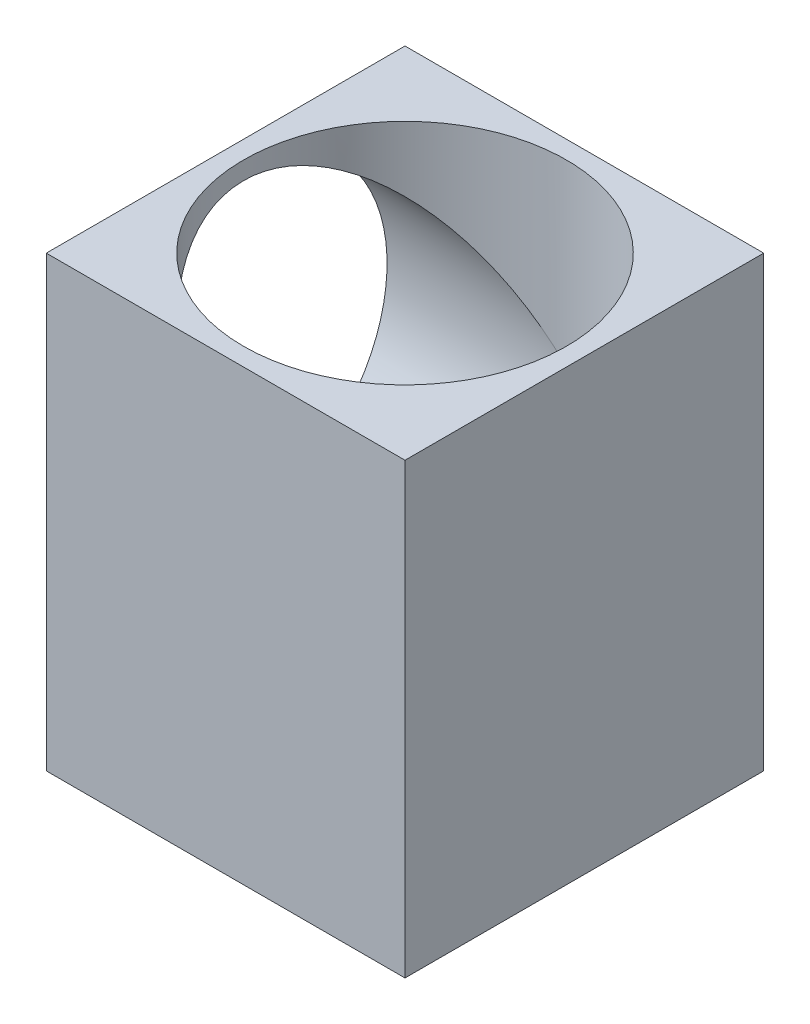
ISO-10303-21;
HEADER;
FILE_DESCRIPTION(('STEP AP214'),'2;1');
FILE_NAME('part.step','',(''),(''),'','','');
FILE_SCHEMA(('AUTOMOTIVE_DESIGN { 1 0 10303 214 1 1 1 1 }'));
ENDSEC;
DATA;
#1=APPLICATION_CONTEXT('core data for automotive mechanical design processes');
#2=APPLICATION_PROTOCOL_DEFINITION('international standard','automotive_design',2000,#1);
#3=PRODUCT_CONTEXT('',#1,'mechanical');
#4=PRODUCT('Part','Part','',(#3));
#5=PRODUCT_RELATED_PRODUCT_CATEGORY('part','',(#4));
#6=PRODUCT_DEFINITION_FORMATION('','',#4);
#7=PRODUCT_DEFINITION_CONTEXT('part definition',#1,'design');
#8=PRODUCT_DEFINITION('design','',#6,#7);
#9=PRODUCT_DEFINITION_SHAPE('','',#8);
#10=(LENGTH_UNIT() NAMED_UNIT(*) SI_UNIT(.MILLI.,.METRE.));
#11=(NAMED_UNIT(*) PLANE_ANGLE_UNIT() SI_UNIT($,.RADIAN.));
#12=(NAMED_UNIT(*) SI_UNIT($,.STERADIAN.) SOLID_ANGLE_UNIT());
#13=UNCERTAINTY_MEASURE_WITH_UNIT(LENGTH_MEASURE(1.E-05),#10,'distance_accuracy_value','');
#14=(GEOMETRIC_REPRESENTATION_CONTEXT(3) GLOBAL_UNCERTAINTY_ASSIGNED_CONTEXT((#13)) GLOBAL_UNIT_ASSIGNED_CONTEXT((#10,
#11,#12)) REPRESENTATION_CONTEXT('',''));
#15=CARTESIAN_POINT('',(0.,0.,0.));
#16=DIRECTION('',(0.,0.,1.));
#17=DIRECTION('',(1.,0.,0.));
#18=AXIS2_PLACEMENT_3D('',#15,#16,#17);
#19=CARTESIAN_POINT('',(0.,0.,0.));
#20=DIRECTION('',(0.,1.,0.));
#21=DIRECTION('',(0.,0.,1.));
#22=AXIS2_PLACEMENT_3D('',#19,#20,#21);
#23=PLANE('',#22);
#24=DIRECTION('',(0.,0.,-1.));
#25=VECTOR('',#24,1.);
#26=CARTESIAN_POINT('',(5.,0.,-5.));
#27=LINE('',#26,#25);
#28=CARTESIAN_POINT('',(5.,0.,5.));
#29=VERTEX_POINT('',#28);
#30=CARTESIAN_POINT('',(5.,0.,-5.));
#31=VERTEX_POINT('',#30);
#32=EDGE_CURVE('E108',#29,#31,#27,.T.);
#33=ORIENTED_EDGE('',*,*,#32,.F.);
#34=DIRECTION('',(1.,0.,0.));
#35=VECTOR('',#34,1.);
#36=CARTESIAN_POINT('',(-5.,0.,5.));
#37=LINE('',#36,#35);
#38=CARTESIAN_POINT('',(-5.,0.,5.));
#39=VERTEX_POINT('',#38);
#40=EDGE_CURVE('E79',#39,#29,#37,.T.);
#41=ORIENTED_EDGE('',*,*,#40,.F.);
#42=DIRECTION('',(0.,0.,1.));
#43=VECTOR('',#42,1.);
#44=CARTESIAN_POINT('',(-5.,0.,-5.));
#45=LINE('',#44,#43);
#46=CARTESIAN_POINT('',(-5.,0.,-5.));
#47=VERTEX_POINT('',#46);
#48=EDGE_CURVE('E125',#47,#39,#45,.T.);
#49=ORIENTED_EDGE('',*,*,#48,.F.);
#50=DIRECTION('',(-1.,0.,0.));
#51=VECTOR('',#50,1.);
#52=CARTESIAN_POINT('',(-5.,0.,-5.));
#53=LINE('',#52,#51);
#54=EDGE_CURVE('E123',#31,#47,#53,.T.);
#55=ORIENTED_EDGE('',*,*,#54,.F.);
#56=EDGE_LOOP('',(#33,#41,#49,#55));
#57=FACE_BOUND('',#56,.T.);
#58=CARTESIAN_POINT('',(0.,0.,0.));
#59=DIRECTION('',(0.,-1.,0.));
#60=DIRECTION('',(0.,0.,-1.));
#61=AXIS2_PLACEMENT_3D('',#58,#59,#60);
#62=CIRCLE('',#61,2.5527);
#63=CARTESIAN_POINT('',(0.,0.,-2.5527));
#64=VERTEX_POINT('',#63);
#65=EDGE_CURVE('E229',#64,#64,#62,.T.);
#66=ORIENTED_EDGE('',*,*,#65,.F.);
#67=EDGE_LOOP('',(#66));
#68=FACE_BOUND('',#67,.T.);
#69=ADVANCED_FACE('F37',(#57,#68),#23,.F.);
#70=CARTESIAN_POINT('',(5.,12.5,-5.));
#71=DIRECTION('',(-1.,0.,0.));
#72=DIRECTION('',(0.,0.,1.));
#73=AXIS2_PLACEMENT_3D('',#70,#71,#72);
#74=PLANE('',#73);
#75=ORIENTED_EDGE('',*,*,#32,.T.);
#76=DIRECTION('',(0.,-1.,0.));
#77=VECTOR('',#76,1.);
#78=CARTESIAN_POINT('',(5.,12.5,-5.));
#79=LINE('',#78,#77);
#80=CARTESIAN_POINT('',(5.,12.5,-5.));
#81=VERTEX_POINT('',#80);
#82=EDGE_CURVE('E91',#81,#31,#79,.T.);
#83=ORIENTED_EDGE('',*,*,#82,.F.);
#84=DIRECTION('',(0.,0.,-1.));
#85=VECTOR('',#84,1.);
#86=CARTESIAN_POINT('',(5.,12.5,-5.));
#87=LINE('',#86,#85);
#88=CARTESIAN_POINT('',(5.,12.5,5.));
#89=VERTEX_POINT('',#88);
#90=EDGE_CURVE('E114',#89,#81,#87,.T.);
#91=ORIENTED_EDGE('',*,*,#90,.F.);
#92=DIRECTION('',(0.,-1.,0.));
#93=VECTOR('',#92,1.);
#94=CARTESIAN_POINT('',(5.,12.5,5.));
#95=LINE('',#94,#93);
#96=EDGE_CURVE('E120',#89,#29,#95,.T.);
#97=ORIENTED_EDGE('',*,*,#96,.T.);
#98=EDGE_LOOP('',(#75,#83,#91,#97));
#99=FACE_BOUND('',#98,.T.);
#100=ADVANCED_FACE('F39',(#99),#74,.F.);
#101=CARTESIAN_POINT('',(-5.,12.5,-5.));
#102=DIRECTION('',(0.,0.,1.));
#103=DIRECTION('',(1.,0.,0.));
#104=AXIS2_PLACEMENT_3D('',#101,#102,#103);
#105=PLANE('',#104);
#106=ORIENTED_EDGE('',*,*,#54,.T.);
#107=DIRECTION('',(0.,-1.,0.));
#108=VECTOR('',#107,1.);
#109=CARTESIAN_POINT('',(-5.,12.5,-5.));
#110=LINE('',#109,#108);
#111=CARTESIAN_POINT('',(-5.,12.5,-5.));
#112=VERTEX_POINT('',#111);
#113=EDGE_CURVE('E131',#112,#47,#110,.T.);
#114=ORIENTED_EDGE('',*,*,#113,.F.);
#115=DIRECTION('',(-1.,0.,0.));
#116=VECTOR('',#115,1.);
#117=CARTESIAN_POINT('',(-5.,12.5,-5.));
#118=LINE('',#117,#116);
#119=EDGE_CURVE('E87',#81,#112,#118,.T.);
#120=ORIENTED_EDGE('',*,*,#119,.F.);
#121=ORIENTED_EDGE('',*,*,#82,.T.);
#122=EDGE_LOOP('',(#106,#114,#120,#121));
#123=FACE_BOUND('',#122,.T.);
#124=ADVANCED_FACE('F135',(#123),#105,.F.);
#125=CARTESIAN_POINT('',(-5.,12.5,-5.));
#126=DIRECTION('',(1.,0.,0.));
#127=DIRECTION('',(0.,0.,-1.));
#128=AXIS2_PLACEMENT_3D('',#125,#126,#127);
#129=PLANE('',#128);
#130=CARTESIAN_POINT('',(-5.,7.5,0.));
#131=DIRECTION('',(-1.,0.,0.));
#132=DIRECTION('',(0.,0.,1.));
#133=AXIS2_PLACEMENT_3D('',#130,#131,#132);
#134=CIRCLE('',#133,4.5);
#135=CARTESIAN_POINT('',(-5.,7.5,4.5));
#136=VERTEX_POINT('',#135);
#137=EDGE_CURVE('E106',#136,#136,#134,.T.);
#138=ORIENTED_EDGE('',*,*,#137,.F.);
#139=EDGE_LOOP('',(#138));
#140=FACE_BOUND('',#139,.T.);
#141=ORIENTED_EDGE('',*,*,#48,.T.);
#142=DIRECTION('',(0.,-1.,0.));
#143=VECTOR('',#142,1.);
#144=CARTESIAN_POINT('',(-5.,12.5,5.));
#145=LINE('',#144,#143);
#146=CARTESIAN_POINT('',(-5.,12.5,5.));
#147=VERTEX_POINT('',#146);
#148=EDGE_CURVE('E129',#147,#39,#145,.T.);
#149=ORIENTED_EDGE('',*,*,#148,.F.);
#150=DIRECTION('',(0.,0.,1.));
#151=VECTOR('',#150,1.);
#152=CARTESIAN_POINT('',(-5.,12.5,-5.));
#153=LINE('',#152,#151);
#154=EDGE_CURVE('E117',#112,#147,#153,.T.);
#155=ORIENTED_EDGE('',*,*,#154,.F.);
#156=ORIENTED_EDGE('',*,*,#113,.T.);
#157=EDGE_LOOP('',(#141,#149,#155,#156));
#158=FACE_BOUND('',#157,.T.);
#159=ADVANCED_FACE('F144',(#140,#158),#129,.F.);
#160=CARTESIAN_POINT('',(-5.,12.5,5.));
#161=DIRECTION('',(0.,0.,-1.));
#162=DIRECTION('',(-1.,0.,0.));
#163=AXIS2_PLACEMENT_3D('',#160,#161,#162);
#164=PLANE('',#163);
#165=ORIENTED_EDGE('',*,*,#40,.T.);
#166=ORIENTED_EDGE('',*,*,#96,.F.);
#167=DIRECTION('',(1.,0.,0.));
#168=VECTOR('',#167,1.);
#169=CARTESIAN_POINT('',(-5.,12.5,5.));
#170=LINE('',#169,#168);
#171=EDGE_CURVE('E58',#147,#89,#170,.T.);
#172=ORIENTED_EDGE('',*,*,#171,.F.);
#173=ORIENTED_EDGE('',*,*,#148,.T.);
#174=EDGE_LOOP('',(#165,#166,#172,#173));
#175=FACE_BOUND('',#174,.T.);
#176=ADVANCED_FACE('F146',(#175),#164,.F.);
#177=CARTESIAN_POINT('',(0.,12.5,0.));
#178=DIRECTION('',(0.,1.,0.));
#179=DIRECTION('',(0.,0.,1.));
#180=AXIS2_PLACEMENT_3D('',#177,#178,#179);
#181=PLANE('',#180);
#182=CARTESIAN_POINT('',(0.,12.5,0.));
#183=DIRECTION('',(0.,1.,0.));
#184=DIRECTION('',(0.,0.,1.));
#185=AXIS2_PLACEMENT_3D('',#182,#183,#184);
#186=CIRCLE('',#185,4.5);
#187=CARTESIAN_POINT('',(0.,12.5,4.5));
#188=VERTEX_POINT('',#187);
#189=EDGE_CURVE('E104',#188,#188,#186,.T.);
#190=ORIENTED_EDGE('',*,*,#189,.F.);
#191=EDGE_LOOP('',(#190));
#192=FACE_BOUND('',#191,.T.);
#193=ORIENTED_EDGE('',*,*,#90,.T.);
#194=ORIENTED_EDGE('',*,*,#119,.T.);
#195=ORIENTED_EDGE('',*,*,#154,.T.);
#196=ORIENTED_EDGE('',*,*,#171,.T.);
#197=EDGE_LOOP('',(#193,#194,#195,#196));
#198=FACE_BOUND('',#197,.T.);
#199=ADVANCED_FACE('F96',(#192,#198),#181,.T.);
#200=CARTESIAN_POINT('',(0.,2.5,0.));
#201=DIRECTION('',(0.,1.,0.));
#202=DIRECTION('',(0.,0.,1.));
#203=AXIS2_PLACEMENT_3D('',#200,#201,#202);
#204=CYLINDRICAL_SURFACE('',#203,4.5);
#205=CARTESIAN_POINT('',(0.,7.5,0.));
#206=DIRECTION('',(0.707106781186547,0.707106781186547,0.));
#207=DIRECTION('',(-0.707106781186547,0.707106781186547,0.));
#208=AXIS2_PLACEMENT_3D('',#205,#206,#207);
#209=ELLIPSE('',#208,6.36396103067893,4.5);
#210=CARTESIAN_POINT('',(0.,7.5,4.5));
#211=VERTEX_POINT('',#210);
#212=CARTESIAN_POINT('',(0.,7.5,-4.5));
#213=VERTEX_POINT('',#212);
#214=EDGE_CURVE('E45',#211,#213,#209,.F.);
#215=ORIENTED_EDGE('',*,*,#214,.T.);
#216=CARTESIAN_POINT('',(0.,7.5,0.));
#217=DIRECTION('',(-0.707106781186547,0.707106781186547,0.));
#218=DIRECTION('',(0.707106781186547,0.707106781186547,0.));
#219=AXIS2_PLACEMENT_3D('',#216,#217,#218);
#220=ELLIPSE('',#219,6.36396103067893,4.5);
#221=EDGE_CURVE('E11',#213,#211,#220,.T.);
#222=ORIENTED_EDGE('',*,*,#221,.T.);
#223=EDGE_LOOP('',(#215,#222));
#224=FACE_BOUND('',#223,.T.);
#225=CARTESIAN_POINT('',(0.,2.5,0.));
#226=DIRECTION('',(0.,1.,0.));
#227=DIRECTION('',(0.,0.,1.));
#228=AXIS2_PLACEMENT_3D('',#225,#226,#227);
#229=CIRCLE('',#228,4.5);
#230=CARTESIAN_POINT('',(0.,2.5,4.5));
#231=VERTEX_POINT('',#230);
#232=EDGE_CURVE('E101',#231,#231,#229,.T.);
#233=ORIENTED_EDGE('',*,*,#232,.F.);
#234=EDGE_LOOP('',(#233));
#235=FACE_BOUND('',#234,.T.);
#236=ORIENTED_EDGE('',*,*,#189,.T.);
#237=EDGE_LOOP('',(#236));
#238=FACE_BOUND('',#237,.T.);
#239=ADVANCED_FACE('F92',(#224,#235,#238),#204,.F.);
#240=CARTESIAN_POINT('',(0.,2.5,0.));
#241=DIRECTION('',(0.,1.,0.));
#242=DIRECTION('',(0.,0.,1.));
#243=AXIS2_PLACEMENT_3D('',#240,#241,#242);
#244=PLANE('',#243);
#245=CARTESIAN_POINT('',(0.,2.5,0.));
#246=DIRECTION('',(0.,1.,0.));
#247=DIRECTION('',(0.,0.,1.));
#248=AXIS2_PLACEMENT_3D('',#245,#246,#247);
#249=CIRCLE('',#248,2.5527);
#250=CARTESIAN_POINT('',(0.,2.5,2.5527));
#251=VERTEX_POINT('',#250);
#252=EDGE_CURVE('E111',#251,#251,#249,.T.);
#253=ORIENTED_EDGE('',*,*,#252,.F.);
#254=EDGE_LOOP('',(#253));
#255=FACE_BOUND('',#254,.T.);
#256=ORIENTED_EDGE('',*,*,#232,.T.);
#257=EDGE_LOOP('',(#256));
#258=FACE_BOUND('',#257,.T.);
#259=ADVANCED_FACE('F95',(#255,#258),#244,.T.);
#260=CARTESIAN_POINT('',(0.,7.5,0.));
#261=DIRECTION('',(-1.,0.,0.));
#262=DIRECTION('',(0.,0.,1.));
#263=AXIS2_PLACEMENT_3D('',#260,#261,#262);
#264=CYLINDRICAL_SURFACE('',#263,4.5);
#265=ORIENTED_EDGE('',*,*,#137,.T.);
#266=EDGE_LOOP('',(#265));
#267=FACE_BOUND('',#266,.T.);
#268=ORIENTED_EDGE('',*,*,#214,.F.);
#269=ORIENTED_EDGE('',*,*,#221,.F.);
#270=EDGE_LOOP('',(#268,#269));
#271=FACE_BOUND('',#270,.T.);
#272=ADVANCED_FACE('F89',(#267,#271),#264,.F.);
#273=CARTESIAN_POINT('',(0.,0.,0.));
#274=DIRECTION('',(0.,-1.,0.));
#275=DIRECTION('',(0.,0.,-1.));
#276=AXIS2_PLACEMENT_3D('',#273,#274,#275);
#277=CYLINDRICAL_SURFACE('',#276,2.5527);
#278=ORIENTED_EDGE('',*,*,#65,.T.);
#279=EDGE_LOOP('',(#278));
#280=FACE_BOUND('',#279,.T.);
#281=ORIENTED_EDGE('',*,*,#252,.T.);
#282=EDGE_LOOP('',(#281));
#283=FACE_BOUND('',#282,.T.);
#284=ADVANCED_FACE('F203',(#280,#283),#277,.F.);
#285=CLOSED_SHELL('',(#69,#100,#124,#159,#176,#199,#239,#259,#272,#284));
#286=MANIFOLD_SOLID_BREP('B2',#285);
#287=ADVANCED_BREP_SHAPE_REPRESENTATION('',(#18,#286),#14);
#288=SHAPE_DEFINITION_REPRESENTATION(#9,#287);
ENDSEC;
END-ISO-10303-21;
